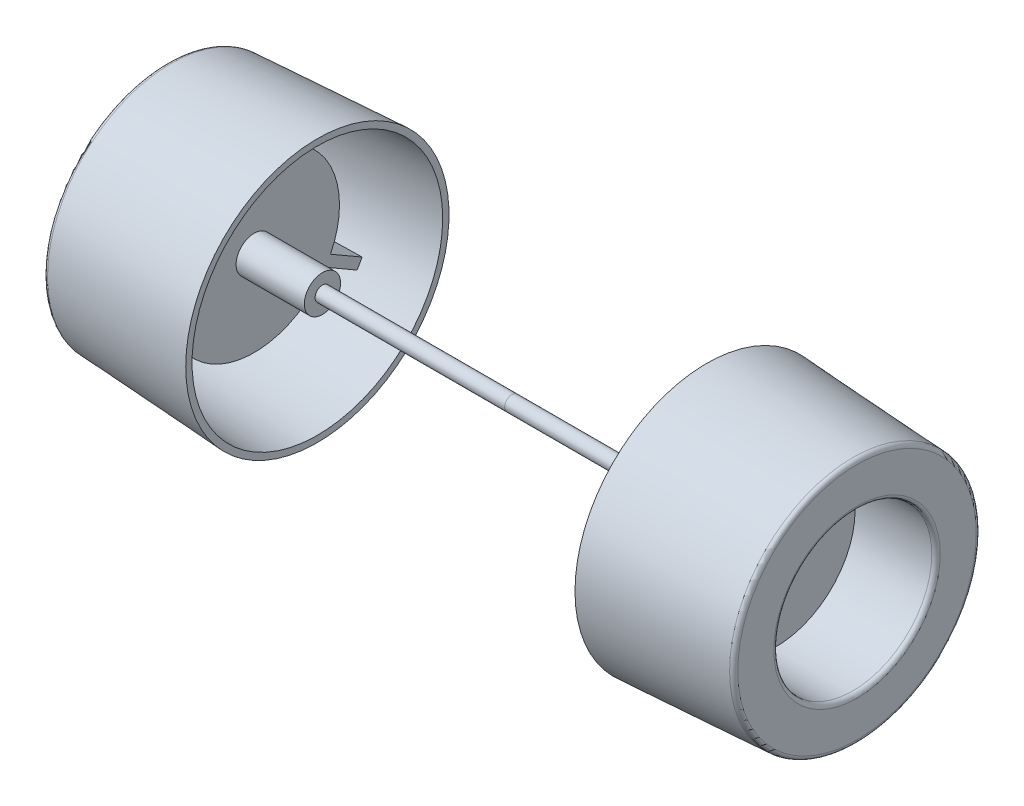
from build123d import *

# Parameters (mm, degrees)
CROQUIS2_R            = 31.25
CROQUIS1_R            = 29.25
CROQUIS3_R            = 18.75
CORTAR_EXTRUIR1_DEPTH = 19.2
VACIADO1_T            = -1.5
EXTRUIR1_START        = -8
EXTRUIR1_DEPTH        = 8
CROQUIS5_R            = 4.3
CROQUIS5_R_2          = 1.745
EXTRUIR2_DEPTH        = 16.2
REDONDEO1_R           = 1
CROQUIS6_R            = 1.745
EXTRUIR3_DEPTH        = 45


with BuildPart() as part:
    # Croquis2 → Recubrir1 section 0
    with BuildSketch(Plane(origin=(-35.7, 0, 0), x_dir=(0, 0, -1), z_dir=(1, 0, 0))):
        Circle(CROQUIS2_R)
    # Croquis1 → Recubrir1 section 1
    with BuildSketch(Plane(origin=(0, 0, 0), x_dir=(0, 0, -1), z_dir=(1, 0, 0))):
        Circle(CROQUIS1_R)
    loft()

    # Croquis3 → Cortar-Extruir1 (cut)
    with BuildSketch(Plane(origin=(0, 0, 0), x_dir=(0, 0, -1), z_dir=(1, 0, 0))):
        Circle(CROQUIS3_R)
    extrude(amount=-CORTAR_EXTRUIR1_DEPTH, mode=Mode.SUBTRACT)

    # Vaciado1
    vaciado1_openings = [part.faces().sort_by_distance(p)[0] for p in [
        (-35.7, 0, 0),
    ]]
    offset(amount=VACIADO1_T, openings=vaciado1_openings, kind=Kind.INTERSECTION)

    # Croquis4 → Extruir1 (add)
    with BuildSketch(Plane.ZY.offset(20.7).offset(EXTRUIR1_START)):
        with BuildLine():
            Line((1.202336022, 20.214274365), (1.202336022, 29.72334011))
            ThreePointArc((1.202336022, 29.72334011), (0, 29.747647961), (-1.202336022, 29.72334011))
            Line((-1.202336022, 29.72334011), (-1.202336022, 20.214274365))
            ThreePointArc((-1.202336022, 20.214274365), (0, 20.25), (1.202336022, 20.214274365))
        make_face()
        with BuildLine():
            Line((16.904907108, -11.148390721), (25.13999961, -15.902923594))
            ThreePointArc((25.13999961, -15.902923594), (25.762218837, -14.873823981), (26.342335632, -13.820416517))
            Line((26.342335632, -13.820416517), (18.10724313, -9.065883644))
            ThreePointArc((18.10724313, -9.065883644), (17.537014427, -10.125), (16.904907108, -11.148390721))
        make_face()
        with BuildLine():
            Line((-18.10724313, -9.065883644), (-26.342335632, -13.820416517))
            ThreePointArc((-26.342335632, -13.820416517), (-25.762218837, -14.873823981), (-25.13999961, -15.902923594))
            Line((-25.13999961, -15.902923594), (-16.904907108, -11.148390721))
            ThreePointArc((-16.904907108, -11.148390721), (-17.537014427, -10.125), (-18.10724313, -9.065883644))
        make_face()
    extrude(amount=EXTRUIR1_DEPTH)

    # Croquis5 → Extruir2 (add)
    with BuildSketch(Plane.ZY.offset(20.7)):
        with Locations(Location((0, 0, 0), (0, 0, 180))):
            Circle(CROQUIS5_R)
        Circle(CROQUIS5_R_2, mode=Mode.SUBTRACT)
    extrude(amount=EXTRUIR2_DEPTH)

    # Redondeo1
    redondeo1_edges = [part.edges().sort_by_distance(p)[0] for p in [
        (0, 0, 29.25),
        (0, 0, 18.75),
    ]]
    fillet(redondeo1_edges, radius=REDONDEO1_R)


with BuildPart() as body_2:
    # Croquis6 → Extruir3 (new body)
    with BuildSketch(Plane.ZY.offset(36.9)):
        with Locations(Location((0, 0, 0), (0, 0, 180))):
            Circle(CROQUIS6_R)
    extrude(amount=EXTRUIR3_DEPTH)


with BuildPart() as body_3:
    # Simetr_a1: mirrored copy
    add(body_2.part.mirror(Plane.ZY.offset(81.9)))


with BuildPart() as body_4:
    # Simetr_a1 2: mirrored copy
    add(part.part.mirror(Plane.ZY.offset(81.9)))


solid = Compound([part.part, body_2.part, body_3.part, body_4.part])
